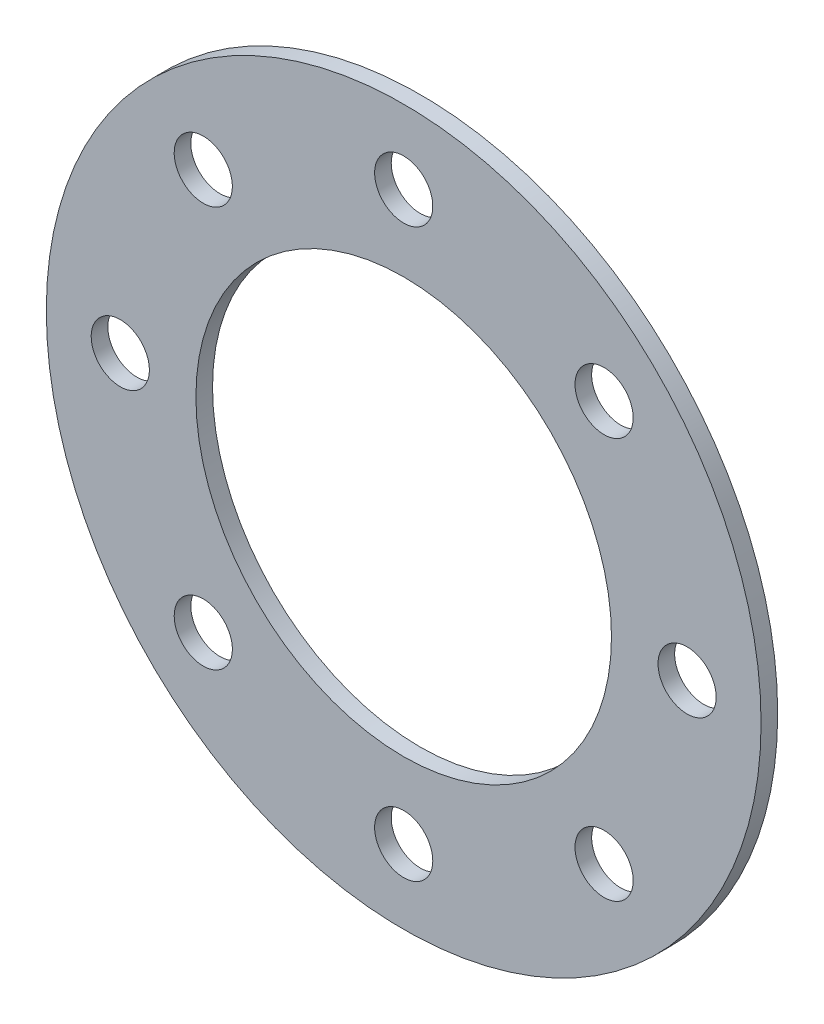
ISO-10303-21;
HEADER;
FILE_DESCRIPTION(('STEP AP214'),'2;1');
FILE_NAME('part.step','',(''),(''),'','','');
FILE_SCHEMA(('AUTOMOTIVE_DESIGN { 1 0 10303 214 1 1 1 1 }'));
ENDSEC;
DATA;
#1=APPLICATION_CONTEXT('core data for automotive mechanical design processes');
#2=APPLICATION_PROTOCOL_DEFINITION('international standard','automotive_design',2000,#1);
#3=PRODUCT_CONTEXT('',#1,'mechanical');
#4=PRODUCT('Part','Part','',(#3));
#5=PRODUCT_RELATED_PRODUCT_CATEGORY('part','',(#4));
#6=PRODUCT_DEFINITION_FORMATION('','',#4);
#7=PRODUCT_DEFINITION_CONTEXT('part definition',#1,'design');
#8=PRODUCT_DEFINITION('design','',#6,#7);
#9=PRODUCT_DEFINITION_SHAPE('','',#8);
#10=(LENGTH_UNIT() NAMED_UNIT(*) SI_UNIT(.MILLI.,.METRE.));
#11=(NAMED_UNIT(*) PLANE_ANGLE_UNIT() SI_UNIT($,.RADIAN.));
#12=(NAMED_UNIT(*) SI_UNIT($,.STERADIAN.) SOLID_ANGLE_UNIT());
#13=UNCERTAINTY_MEASURE_WITH_UNIT(LENGTH_MEASURE(1.E-05),#10,'distance_accuracy_value','');
#14=(GEOMETRIC_REPRESENTATION_CONTEXT(3) GLOBAL_UNCERTAINTY_ASSIGNED_CONTEXT((#13)) GLOBAL_UNIT_ASSIGNED_CONTEXT((#10,
#11,#12)) REPRESENTATION_CONTEXT('',''));
#15=CARTESIAN_POINT('',(0.,0.,0.));
#16=DIRECTION('',(0.,0.,1.));
#17=DIRECTION('',(1.,0.,0.));
#18=AXIS2_PLACEMENT_3D('',#15,#16,#17);
#19=CARTESIAN_POINT('',(0.,0.,2.));
#20=DIRECTION('',(0.,0.,1.));
#21=DIRECTION('',(1.,0.,0.));
#22=AXIS2_PLACEMENT_3D('',#19,#20,#21);
#23=PLANE('',#22);
#24=CARTESIAN_POINT('',(24.112341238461,24.1123412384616,2.));
#25=DIRECTION('',(0.,0.,-1.));
#26=DIRECTION('',(-0.707106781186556,0.707106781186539,0.));
#27=AXIS2_PLACEMENT_3D('',#24,#25,#26);
#28=CIRCLE('',#27,3.5);
#29=CARTESIAN_POINT('',(21.637467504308,26.5872149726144,2.));
#30=VERTEX_POINT('',#29);
#31=EDGE_CURVE('E87',#30,#30,#28,.T.);
#32=ORIENTED_EDGE('',*,*,#31,.T.);
#33=EDGE_LOOP('',(#32));
#34=FACE_BOUND('',#33,.T.);
#35=CARTESIAN_POINT('',(34.1,3.53709094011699E-13,2.));
#36=DIRECTION('',(0.,0.,-1.));
#37=DIRECTION('',(0.,1.,0.));
#38=AXIS2_PLACEMENT_3D('',#35,#36,#37);
#39=CIRCLE('',#38,3.5);
#40=CARTESIAN_POINT('',(34.1,3.50000000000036,2.));
#41=VERTEX_POINT('',#40);
#42=EDGE_CURVE('E81',#41,#41,#39,.T.);
#43=ORIENTED_EDGE('',*,*,#42,.T.);
#44=EDGE_LOOP('',(#43));
#45=FACE_BOUND('',#44,.T.);
#46=CARTESIAN_POINT('',(24.1123412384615,-24.1123412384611,2.));
#47=DIRECTION('',(0.,0.,-1.));
#48=DIRECTION('',(0.707106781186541,0.707106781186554,0.));
#49=AXIS2_PLACEMENT_3D('',#46,#47,#48);
#50=CIRCLE('',#49,3.5);
#51=CARTESIAN_POINT('',(26.5872149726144,-21.6374675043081,2.));
#52=VERTEX_POINT('',#51);
#53=EDGE_CURVE('E75',#52,#52,#50,.T.);
#54=ORIENTED_EDGE('',*,*,#53,.T.);
#55=EDGE_LOOP('',(#54));
#56=FACE_BOUND('',#55,.T.);
#57=CARTESIAN_POINT('',(0.,-34.1,2.));
#58=DIRECTION('',(0.,0.,-1.));
#59=DIRECTION('',(1.,0.,0.));
#60=AXIS2_PLACEMENT_3D('',#57,#58,#59);
#61=CIRCLE('',#60,3.5);
#62=CARTESIAN_POINT('',(3.5,-34.1,2.));
#63=VERTEX_POINT('',#62);
#64=EDGE_CURVE('E69',#63,#63,#61,.T.);
#65=ORIENTED_EDGE('',*,*,#64,.T.);
#66=EDGE_LOOP('',(#65));
#67=FACE_BOUND('',#66,.T.);
#68=CARTESIAN_POINT('',(-24.1123412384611,-24.1123412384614,2.));
#69=DIRECTION('',(0.,0.,-1.));
#70=DIRECTION('',(0.707106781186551,-0.707106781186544,0.));
#71=AXIS2_PLACEMENT_3D('',#68,#69,#70);
#72=CIRCLE('',#71,3.5);
#73=CARTESIAN_POINT('',(-21.6374675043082,-26.5872149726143,2.));
#74=VERTEX_POINT('',#73);
#75=EDGE_CURVE('E63',#74,#74,#72,.T.);
#76=ORIENTED_EDGE('',*,*,#75,.T.);
#77=EDGE_LOOP('',(#76));
#78=FACE_BOUND('',#77,.T.);
#79=CARTESIAN_POINT('',(-34.1,-1.15590066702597E-13,2.));
#80=DIRECTION('',(0.,0.,-1.));
#81=DIRECTION('',(0.,-1.,0.));
#82=AXIS2_PLACEMENT_3D('',#79,#80,#81);
#83=CIRCLE('',#82,3.5);
#84=CARTESIAN_POINT('',(-34.1,-3.50000000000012,2.));
#85=VERTEX_POINT('',#84);
#86=EDGE_CURVE('E57',#85,#85,#83,.T.);
#87=ORIENTED_EDGE('',*,*,#86,.T.);
#88=EDGE_LOOP('',(#87));
#89=FACE_BOUND('',#88,.T.);
#90=CARTESIAN_POINT('',(-24.1123412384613,24.1123412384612,2.));
#91=DIRECTION('',(0.,0.,-1.));
#92=DIRECTION('',(-0.707106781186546,-0.707106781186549,0.));
#93=AXIS2_PLACEMENT_3D('',#90,#91,#92);
#94=CIRCLE('',#93,3.5);
#95=CARTESIAN_POINT('',(-26.5872149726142,21.6374675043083,2.));
#96=VERTEX_POINT('',#95);
#97=EDGE_CURVE('E51',#96,#96,#94,.T.);
#98=ORIENTED_EDGE('',*,*,#97,.T.);
#99=EDGE_LOOP('',(#98));
#100=FACE_BOUND('',#99,.T.);
#101=CARTESIAN_POINT('',(0.,34.1,2.));
#102=DIRECTION('',(0.,0.,-1.));
#103=DIRECTION('',(-1.,0.,0.));
#104=AXIS2_PLACEMENT_3D('',#101,#102,#103);
#105=CIRCLE('',#104,3.5);
#106=CARTESIAN_POINT('',(-3.5,34.1,2.));
#107=VERTEX_POINT('',#106);
#108=EDGE_CURVE('E45',#107,#107,#105,.T.);
#109=ORIENTED_EDGE('',*,*,#108,.T.);
#110=EDGE_LOOP('',(#109));
#111=FACE_BOUND('',#110,.T.);
#112=CARTESIAN_POINT('',(0.,0.,2.));
#113=DIRECTION('',(0.,0.,1.));
#114=DIRECTION('',(1.,0.,0.));
#115=AXIS2_PLACEMENT_3D('',#112,#113,#114);
#116=CIRCLE('',#115,43.);
#117=CARTESIAN_POINT('',(43.,0.,2.));
#118=VERTEX_POINT('',#117);
#119=EDGE_CURVE('E10',#118,#118,#116,.T.);
#120=ORIENTED_EDGE('',*,*,#119,.T.);
#121=EDGE_LOOP('',(#120));
#122=FACE_BOUND('',#121,.T.);
#123=CARTESIAN_POINT('',(0.,0.,2.));
#124=DIRECTION('',(0.,0.,1.));
#125=DIRECTION('',(1.,0.,0.));
#126=AXIS2_PLACEMENT_3D('',#123,#124,#125);
#127=CIRCLE('',#126,25.);
#128=CARTESIAN_POINT('',(25.,0.,2.));
#129=VERTEX_POINT('',#128);
#130=EDGE_CURVE('E40',#129,#129,#127,.T.);
#131=ORIENTED_EDGE('',*,*,#130,.F.);
#132=EDGE_LOOP('',(#131));
#133=FACE_BOUND('',#132,.T.);
#134=ADVANCED_FACE('F29',(#34,#45,#56,#67,#78,#89,#100,#111,#122,#133),#23,.T.);
#135=CARTESIAN_POINT('',(0.,0.,0.));
#136=DIRECTION('',(0.,0.,1.));
#137=DIRECTION('',(1.,0.,0.));
#138=AXIS2_PLACEMENT_3D('',#135,#136,#137);
#139=PLANE('',#138);
#140=CARTESIAN_POINT('',(24.112341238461,24.1123412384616,0.));
#141=DIRECTION('',(0.,0.,-1.));
#142=DIRECTION('',(-0.707106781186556,0.707106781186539,0.));
#143=AXIS2_PLACEMENT_3D('',#140,#141,#142);
#144=CIRCLE('',#143,3.5);
#145=CARTESIAN_POINT('',(21.637467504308,26.5872149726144,0.));
#146=VERTEX_POINT('',#145);
#147=EDGE_CURVE('E90',#146,#146,#144,.T.);
#148=ORIENTED_EDGE('',*,*,#147,.F.);
#149=EDGE_LOOP('',(#148));
#150=FACE_BOUND('',#149,.T.);
#151=CARTESIAN_POINT('',(34.1,3.53709094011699E-13,0.));
#152=DIRECTION('',(0.,0.,-1.));
#153=DIRECTION('',(0.,1.,0.));
#154=AXIS2_PLACEMENT_3D('',#151,#152,#153);
#155=CIRCLE('',#154,3.5);
#156=CARTESIAN_POINT('',(34.1,3.50000000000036,0.));
#157=VERTEX_POINT('',#156);
#158=EDGE_CURVE('E84',#157,#157,#155,.T.);
#159=ORIENTED_EDGE('',*,*,#158,.F.);
#160=EDGE_LOOP('',(#159));
#161=FACE_BOUND('',#160,.T.);
#162=CARTESIAN_POINT('',(24.1123412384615,-24.1123412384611,0.));
#163=DIRECTION('',(0.,0.,-1.));
#164=DIRECTION('',(0.707106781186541,0.707106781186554,0.));
#165=AXIS2_PLACEMENT_3D('',#162,#163,#164);
#166=CIRCLE('',#165,3.5);
#167=CARTESIAN_POINT('',(26.5872149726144,-21.6374675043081,0.));
#168=VERTEX_POINT('',#167);
#169=EDGE_CURVE('E78',#168,#168,#166,.T.);
#170=ORIENTED_EDGE('',*,*,#169,.F.);
#171=EDGE_LOOP('',(#170));
#172=FACE_BOUND('',#171,.T.);
#173=CARTESIAN_POINT('',(0.,-34.1,0.));
#174=DIRECTION('',(0.,0.,-1.));
#175=DIRECTION('',(1.,0.,0.));
#176=AXIS2_PLACEMENT_3D('',#173,#174,#175);
#177=CIRCLE('',#176,3.5);
#178=CARTESIAN_POINT('',(3.5,-34.1,0.));
#179=VERTEX_POINT('',#178);
#180=EDGE_CURVE('E72',#179,#179,#177,.T.);
#181=ORIENTED_EDGE('',*,*,#180,.F.);
#182=EDGE_LOOP('',(#181));
#183=FACE_BOUND('',#182,.T.);
#184=CARTESIAN_POINT('',(-24.1123412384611,-24.1123412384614,0.));
#185=DIRECTION('',(0.,0.,-1.));
#186=DIRECTION('',(0.707106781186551,-0.707106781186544,0.));
#187=AXIS2_PLACEMENT_3D('',#184,#185,#186);
#188=CIRCLE('',#187,3.5);
#189=CARTESIAN_POINT('',(-21.6374675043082,-26.5872149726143,0.));
#190=VERTEX_POINT('',#189);
#191=EDGE_CURVE('E66',#190,#190,#188,.T.);
#192=ORIENTED_EDGE('',*,*,#191,.F.);
#193=EDGE_LOOP('',(#192));
#194=FACE_BOUND('',#193,.T.);
#195=CARTESIAN_POINT('',(-34.1,-1.15590066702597E-13,0.));
#196=DIRECTION('',(0.,0.,-1.));
#197=DIRECTION('',(0.,-1.,0.));
#198=AXIS2_PLACEMENT_3D('',#195,#196,#197);
#199=CIRCLE('',#198,3.5);
#200=CARTESIAN_POINT('',(-34.1,-3.50000000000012,0.));
#201=VERTEX_POINT('',#200);
#202=EDGE_CURVE('E60',#201,#201,#199,.T.);
#203=ORIENTED_EDGE('',*,*,#202,.F.);
#204=EDGE_LOOP('',(#203));
#205=FACE_BOUND('',#204,.T.);
#206=CARTESIAN_POINT('',(-24.1123412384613,24.1123412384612,0.));
#207=DIRECTION('',(0.,0.,-1.));
#208=DIRECTION('',(-0.707106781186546,-0.707106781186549,0.));
#209=AXIS2_PLACEMENT_3D('',#206,#207,#208);
#210=CIRCLE('',#209,3.5);
#211=CARTESIAN_POINT('',(-26.5872149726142,21.6374675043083,0.));
#212=VERTEX_POINT('',#211);
#213=EDGE_CURVE('E54',#212,#212,#210,.T.);
#214=ORIENTED_EDGE('',*,*,#213,.F.);
#215=EDGE_LOOP('',(#214));
#216=FACE_BOUND('',#215,.T.);
#217=CARTESIAN_POINT('',(0.,34.1,0.));
#218=DIRECTION('',(0.,0.,-1.));
#219=DIRECTION('',(-1.,0.,0.));
#220=AXIS2_PLACEMENT_3D('',#217,#218,#219);
#221=CIRCLE('',#220,3.5);
#222=CARTESIAN_POINT('',(-3.5,34.1,0.));
#223=VERTEX_POINT('',#222);
#224=EDGE_CURVE('E48',#223,#223,#221,.T.);
#225=ORIENTED_EDGE('',*,*,#224,.F.);
#226=EDGE_LOOP('',(#225));
#227=FACE_BOUND('',#226,.T.);
#228=CARTESIAN_POINT('',(0.,0.,0.));
#229=DIRECTION('',(0.,0.,1.));
#230=DIRECTION('',(1.,0.,0.));
#231=AXIS2_PLACEMENT_3D('',#228,#229,#230);
#232=CIRCLE('',#231,43.);
#233=CARTESIAN_POINT('',(43.,0.,0.));
#234=VERTEX_POINT('',#233);
#235=EDGE_CURVE('E33',#234,#234,#232,.T.);
#236=ORIENTED_EDGE('',*,*,#235,.F.);
#237=EDGE_LOOP('',(#236));
#238=FACE_BOUND('',#237,.T.);
#239=CARTESIAN_POINT('',(0.,0.,0.));
#240=DIRECTION('',(0.,0.,1.));
#241=DIRECTION('',(1.,0.,0.));
#242=AXIS2_PLACEMENT_3D('',#239,#240,#241);
#243=CIRCLE('',#242,25.);
#244=CARTESIAN_POINT('',(25.,0.,0.));
#245=VERTEX_POINT('',#244);
#246=EDGE_CURVE('E42',#245,#245,#243,.T.);
#247=ORIENTED_EDGE('',*,*,#246,.T.);
#248=EDGE_LOOP('',(#247));
#249=FACE_BOUND('',#248,.T.);
#250=ADVANCED_FACE('F105',(#150,#161,#172,#183,#194,#205,#216,#227,#238,#249),#139,.F.);
#251=CARTESIAN_POINT('',(0.,0.,2.));
#252=DIRECTION('',(0.,0.,-1.));
#253=DIRECTION('',(-1.,0.,0.));
#254=AXIS2_PLACEMENT_3D('',#251,#252,#253);
#255=CYLINDRICAL_SURFACE('',#254,43.);
#256=ORIENTED_EDGE('',*,*,#119,.F.);
#257=EDGE_LOOP('',(#256));
#258=FACE_BOUND('',#257,.T.);
#259=ORIENTED_EDGE('',*,*,#235,.T.);
#260=EDGE_LOOP('',(#259));
#261=FACE_BOUND('',#260,.T.);
#262=ADVANCED_FACE('F31',(#258,#261),#255,.T.);
#263=CARTESIAN_POINT('',(0.,0.,2.));
#264=DIRECTION('',(0.,0.,-1.));
#265=DIRECTION('',(-1.,0.,0.));
#266=AXIS2_PLACEMENT_3D('',#263,#264,#265);
#267=CYLINDRICAL_SURFACE('',#266,25.);
#268=ORIENTED_EDGE('',*,*,#130,.T.);
#269=EDGE_LOOP('',(#268));
#270=FACE_BOUND('',#269,.T.);
#271=ORIENTED_EDGE('',*,*,#246,.F.);
#272=EDGE_LOOP('',(#271));
#273=FACE_BOUND('',#272,.T.);
#274=ADVANCED_FACE('F126',(#270,#273),#267,.F.);
#275=CARTESIAN_POINT('',(0.,34.1,2.));
#276=DIRECTION('',(0.,0.,-1.));
#277=DIRECTION('',(-1.,0.,0.));
#278=AXIS2_PLACEMENT_3D('',#275,#276,#277);
#279=CYLINDRICAL_SURFACE('',#278,3.5);
#280=ORIENTED_EDGE('',*,*,#108,.F.);
#281=EDGE_LOOP('',(#280));
#282=FACE_BOUND('',#281,.T.);
#283=ORIENTED_EDGE('',*,*,#224,.T.);
#284=EDGE_LOOP('',(#283));
#285=FACE_BOUND('',#284,.T.);
#286=ADVANCED_FACE('F128',(#282,#285),#279,.F.);
#287=CARTESIAN_POINT('',(-24.1123412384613,24.1123412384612,2.));
#288=DIRECTION('',(0.,0.,-1.));
#289=DIRECTION('',(-1.,0.,0.));
#290=AXIS2_PLACEMENT_3D('',#287,#288,#289);
#291=CYLINDRICAL_SURFACE('',#290,3.5);
#292=ORIENTED_EDGE('',*,*,#97,.F.);
#293=EDGE_LOOP('',(#292));
#294=FACE_BOUND('',#293,.T.);
#295=ORIENTED_EDGE('',*,*,#213,.T.);
#296=EDGE_LOOP('',(#295));
#297=FACE_BOUND('',#296,.T.);
#298=ADVANCED_FACE('F135',(#294,#297),#291,.F.);
#299=CARTESIAN_POINT('',(-34.1,-1.15590066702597E-13,2.));
#300=DIRECTION('',(0.,0.,-1.));
#301=DIRECTION('',(-1.,0.,0.));
#302=AXIS2_PLACEMENT_3D('',#299,#300,#301);
#303=CYLINDRICAL_SURFACE('',#302,3.5);
#304=ORIENTED_EDGE('',*,*,#86,.F.);
#305=EDGE_LOOP('',(#304));
#306=FACE_BOUND('',#305,.T.);
#307=ORIENTED_EDGE('',*,*,#202,.T.);
#308=EDGE_LOOP('',(#307));
#309=FACE_BOUND('',#308,.T.);
#310=ADVANCED_FACE('F170',(#306,#309),#303,.F.);
#311=CARTESIAN_POINT('',(-24.1123412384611,-24.1123412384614,2.));
#312=DIRECTION('',(0.,0.,-1.));
#313=DIRECTION('',(-1.,0.,0.));
#314=AXIS2_PLACEMENT_3D('',#311,#312,#313);
#315=CYLINDRICAL_SURFACE('',#314,3.5);
#316=ORIENTED_EDGE('',*,*,#75,.F.);
#317=EDGE_LOOP('',(#316));
#318=FACE_BOUND('',#317,.T.);
#319=ORIENTED_EDGE('',*,*,#191,.T.);
#320=EDGE_LOOP('',(#319));
#321=FACE_BOUND('',#320,.T.);
#322=ADVANCED_FACE('F177',(#318,#321),#315,.F.);
#323=CARTESIAN_POINT('',(0.,-34.1,2.));
#324=DIRECTION('',(0.,0.,-1.));
#325=DIRECTION('',(-1.,0.,0.));
#326=AXIS2_PLACEMENT_3D('',#323,#324,#325);
#327=CYLINDRICAL_SURFACE('',#326,3.5);
#328=ORIENTED_EDGE('',*,*,#64,.F.);
#329=EDGE_LOOP('',(#328));
#330=FACE_BOUND('',#329,.T.);
#331=ORIENTED_EDGE('',*,*,#180,.T.);
#332=EDGE_LOOP('',(#331));
#333=FACE_BOUND('',#332,.T.);
#334=ADVANCED_FACE('F185',(#330,#333),#327,.F.);
#335=CARTESIAN_POINT('',(24.1123412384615,-24.1123412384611,2.));
#336=DIRECTION('',(0.,0.,-1.));
#337=DIRECTION('',(-1.,0.,0.));
#338=AXIS2_PLACEMENT_3D('',#335,#336,#337);
#339=CYLINDRICAL_SURFACE('',#338,3.5);
#340=ORIENTED_EDGE('',*,*,#53,.F.);
#341=EDGE_LOOP('',(#340));
#342=FACE_BOUND('',#341,.T.);
#343=ORIENTED_EDGE('',*,*,#169,.T.);
#344=EDGE_LOOP('',(#343));
#345=FACE_BOUND('',#344,.T.);
#346=ADVANCED_FACE('F193',(#342,#345),#339,.F.);
#347=CARTESIAN_POINT('',(34.1,3.53709094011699E-13,2.));
#348=DIRECTION('',(0.,0.,-1.));
#349=DIRECTION('',(-1.,0.,0.));
#350=AXIS2_PLACEMENT_3D('',#347,#348,#349);
#351=CYLINDRICAL_SURFACE('',#350,3.5);
#352=ORIENTED_EDGE('',*,*,#42,.F.);
#353=EDGE_LOOP('',(#352));
#354=FACE_BOUND('',#353,.T.);
#355=ORIENTED_EDGE('',*,*,#158,.T.);
#356=EDGE_LOOP('',(#355));
#357=FACE_BOUND('',#356,.T.);
#358=ADVANCED_FACE('F101',(#354,#357),#351,.F.);
#359=CARTESIAN_POINT('',(24.112341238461,24.1123412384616,2.));
#360=DIRECTION('',(0.,0.,-1.));
#361=DIRECTION('',(-1.,0.,0.));
#362=AXIS2_PLACEMENT_3D('',#359,#360,#361);
#363=CYLINDRICAL_SURFACE('',#362,3.5);
#364=ORIENTED_EDGE('',*,*,#31,.F.);
#365=EDGE_LOOP('',(#364));
#366=FACE_BOUND('',#365,.T.);
#367=ORIENTED_EDGE('',*,*,#147,.T.);
#368=EDGE_LOOP('',(#367));
#369=FACE_BOUND('',#368,.T.);
#370=ADVANCED_FACE('F98',(#366,#369),#363,.F.);
#371=CLOSED_SHELL('',(#134,#250,#262,#274,#286,#298,#310,#322,#334,#346,#358,#370));
#372=MANIFOLD_SOLID_BREP('B2',#371);
#373=ADVANCED_BREP_SHAPE_REPRESENTATION('',(#18,#372),#14);
#374=SHAPE_DEFINITION_REPRESENTATION(#9,#373);
ENDSEC;
END-ISO-10303-21;
